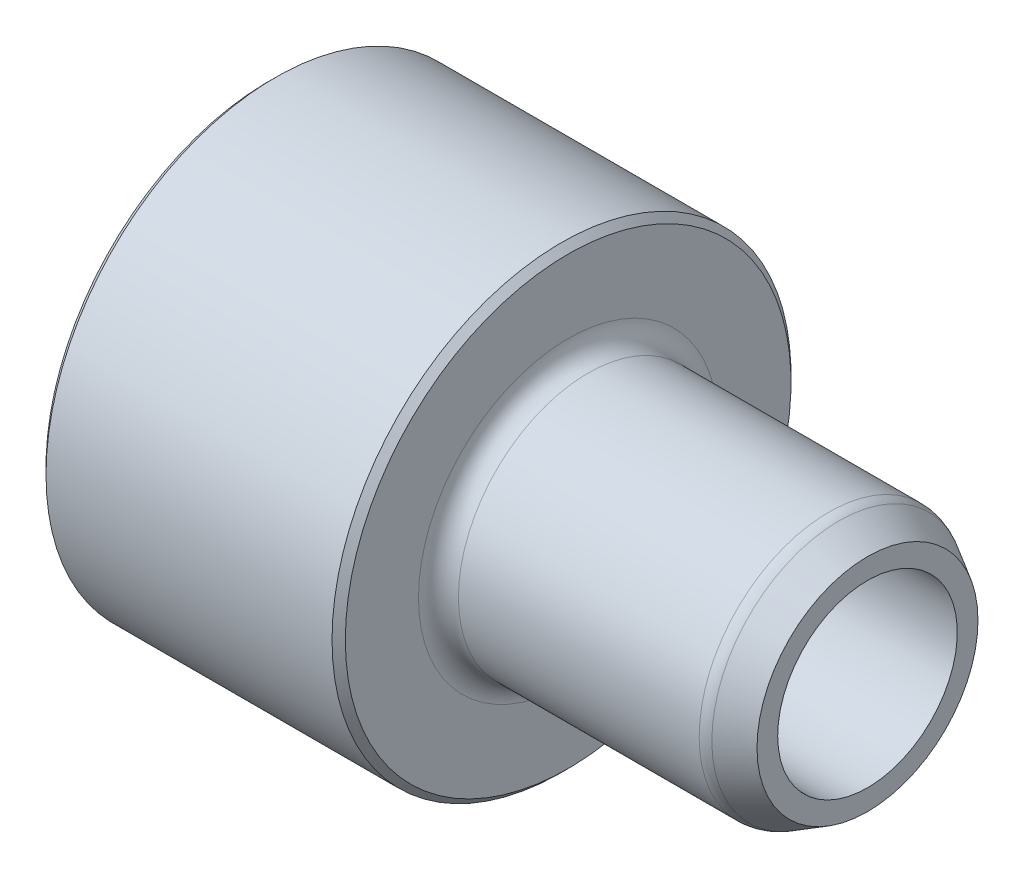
ISO-10303-21;
HEADER;
FILE_DESCRIPTION(('STEP AP214'),'2;1');
FILE_NAME('part.step','',(''),(''),'','','');
FILE_SCHEMA(('AUTOMOTIVE_DESIGN { 1 0 10303 214 1 1 1 1 }'));
ENDSEC;
DATA;
#1=APPLICATION_CONTEXT('core data for automotive mechanical design processes');
#2=APPLICATION_PROTOCOL_DEFINITION('international standard','automotive_design',2000,#1);
#3=PRODUCT_CONTEXT('',#1,'mechanical');
#4=PRODUCT('Part','Part','',(#3));
#5=PRODUCT_RELATED_PRODUCT_CATEGORY('part','',(#4));
#6=PRODUCT_DEFINITION_FORMATION('','',#4);
#7=PRODUCT_DEFINITION_CONTEXT('part definition',#1,'design');
#8=PRODUCT_DEFINITION('design','',#6,#7);
#9=PRODUCT_DEFINITION_SHAPE('','',#8);
#10=(LENGTH_UNIT() NAMED_UNIT(*) SI_UNIT(.MILLI.,.METRE.));
#11=(NAMED_UNIT(*) PLANE_ANGLE_UNIT() SI_UNIT($,.RADIAN.));
#12=(NAMED_UNIT(*) SI_UNIT($,.STERADIAN.) SOLID_ANGLE_UNIT());
#13=UNCERTAINTY_MEASURE_WITH_UNIT(LENGTH_MEASURE(1.E-05),#10,'distance_accuracy_value','');
#14=(GEOMETRIC_REPRESENTATION_CONTEXT(3) GLOBAL_UNCERTAINTY_ASSIGNED_CONTEXT((#13)) GLOBAL_UNIT_ASSIGNED_CONTEXT((#10,
#11,#12)) REPRESENTATION_CONTEXT('',''));
#15=CARTESIAN_POINT('',(0.,0.,0.));
#16=DIRECTION('',(0.,0.,1.));
#17=DIRECTION('',(1.,0.,0.));
#18=AXIS2_PLACEMENT_3D('',#15,#16,#17);
#19=CARTESIAN_POINT('',(0.249999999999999,2.5,0.));
#20=DIRECTION('',(1.,0.,0.));
#21=DIRECTION('',(0.,0.,-1.));
#22=AXIS2_PLACEMENT_3D('',#19,#20,#21);
#23=PLANE('',#22);
#24=CARTESIAN_POINT('',(0.25,0.,0.));
#25=DIRECTION('',(-1.,0.,0.));
#26=DIRECTION('',(0.,0.,1.));
#27=AXIS2_PLACEMENT_3D('',#24,#25,#26);
#28=CIRCLE('',#27,1.35);
#29=CARTESIAN_POINT('',(0.25,0.,1.35));
#30=VERTEX_POINT('',#29);
#31=EDGE_CURVE('E76',#30,#30,#28,.T.);
#32=ORIENTED_EDGE('',*,*,#31,.F.);
#33=EDGE_LOOP('',(#32));
#34=FACE_BOUND('',#33,.T.);
#35=CARTESIAN_POINT('',(0.249999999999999,0.,0.));
#36=DIRECTION('',(-1.,0.,0.));
#37=DIRECTION('',(0.,0.,1.));
#38=AXIS2_PLACEMENT_3D('',#35,#36,#37);
#39=CIRCLE('',#38,2.5);
#40=CARTESIAN_POINT('',(0.249999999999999,0.,2.5));
#41=VERTEX_POINT('',#40);
#42=EDGE_CURVE('E67',#41,#41,#39,.T.);
#43=ORIENTED_EDGE('',*,*,#42,.T.);
#44=EDGE_LOOP('',(#43));
#45=FACE_BOUND('',#44,.T.);
#46=ADVANCED_FACE('F29',(#34,#45),#23,.F.);
#47=CARTESIAN_POINT('',(0.,0.,0.));
#48=DIRECTION('',(-1.,0.,0.));
#49=DIRECTION('',(0.,0.,1.));
#50=AXIS2_PLACEMENT_3D('',#47,#48,#49);
#51=CYLINDRICAL_SURFACE('',#50,2.5);
#52=CARTESIAN_POINT('',(-3.15,0.,0.));
#53=DIRECTION('',(1.,0.,0.));
#54=DIRECTION('',(0.,0.,-1.));
#55=AXIS2_PLACEMENT_3D('',#52,#53,#54);
#56=CIRCLE('',#55,2.5);
#57=CARTESIAN_POINT('',(-3.15,0.,-2.5));
#58=VERTEX_POINT('',#57);
#59=EDGE_CURVE('E36',#58,#58,#56,.F.);
#60=ORIENTED_EDGE('',*,*,#59,.T.);
#61=EDGE_LOOP('',(#60));
#62=FACE_BOUND('',#61,.T.);
#63=ORIENTED_EDGE('',*,*,#42,.F.);
#64=EDGE_LOOP('',(#63));
#65=FACE_BOUND('',#64,.T.);
#66=ADVANCED_FACE('F84',(#62,#65),#51,.F.);
#67=CARTESIAN_POINT('',(-3.25,3.45,0.));
#68=DIRECTION('',(1.,0.,0.));
#69=DIRECTION('',(0.,0.,-1.));
#70=AXIS2_PLACEMENT_3D('',#67,#68,#69);
#71=PLANE('',#70);
#72=CARTESIAN_POINT('',(-3.25,0.,0.));
#73=DIRECTION('',(1.,0.,0.));
#74=DIRECTION('',(0.,0.,-1.));
#75=AXIS2_PLACEMENT_3D('',#72,#73,#74);
#76=CIRCLE('',#75,3.35);
#77=CARTESIAN_POINT('',(-3.25,0.,-3.35));
#78=VERTEX_POINT('',#77);
#79=EDGE_CURVE('E49',#78,#78,#76,.F.);
#80=ORIENTED_EDGE('',*,*,#79,.T.);
#81=EDGE_LOOP('',(#80));
#82=FACE_BOUND('',#81,.T.);
#83=CARTESIAN_POINT('',(-3.25,0.,0.));
#84=DIRECTION('',(1.,0.,0.));
#85=DIRECTION('',(0.,0.,-1.));
#86=AXIS2_PLACEMENT_3D('',#83,#84,#85);
#87=CIRCLE('',#86,2.6);
#88=CARTESIAN_POINT('',(-3.25,0.,-2.6));
#89=VERTEX_POINT('',#88);
#90=EDGE_CURVE('E52',#89,#89,#87,.T.);
#91=ORIENTED_EDGE('',*,*,#90,.T.);
#92=EDGE_LOOP('',(#91));
#93=FACE_BOUND('',#92,.T.);
#94=ADVANCED_FACE('F89',(#82,#93),#71,.F.);
#95=CARTESIAN_POINT('',(0.,0.,0.));
#96=DIRECTION('',(-1.,0.,0.));
#97=DIRECTION('',(0.,0.,1.));
#98=AXIS2_PLACEMENT_3D('',#95,#96,#97);
#99=CYLINDRICAL_SURFACE('',#98,3.45);
#100=CARTESIAN_POINT('',(-3.15,0.,0.));
#101=DIRECTION('',(1.,0.,0.));
#102=DIRECTION('',(0.,0.,-1.));
#103=AXIS2_PLACEMENT_3D('',#100,#101,#102);
#104=CIRCLE('',#103,3.45);
#105=CARTESIAN_POINT('',(-3.15,0.,-3.45));
#106=VERTEX_POINT('',#105);
#107=EDGE_CURVE('E40',#106,#106,#104,.T.);
#108=ORIENTED_EDGE('',*,*,#107,.T.);
#109=EDGE_LOOP('',(#108));
#110=FACE_BOUND('',#109,.T.);
#111=CARTESIAN_POINT('',(1.15,0.,0.));
#112=DIRECTION('',(-1.,0.,0.));
#113=DIRECTION('',(0.,0.,1.));
#114=AXIS2_PLACEMENT_3D('',#111,#112,#113);
#115=CIRCLE('',#114,3.45);
#116=CARTESIAN_POINT('',(1.15,0.,3.45));
#117=VERTEX_POINT('',#116);
#118=EDGE_CURVE('E44',#117,#117,#115,.T.);
#119=ORIENTED_EDGE('',*,*,#118,.T.);
#120=EDGE_LOOP('',(#119));
#121=FACE_BOUND('',#120,.T.);
#122=ADVANCED_FACE('F94',(#110,#121),#99,.T.);
#123=CARTESIAN_POINT('',(1.25,1.95,0.));
#124=DIRECTION('',(-1.,0.,0.));
#125=DIRECTION('',(0.,0.,1.));
#126=AXIS2_PLACEMENT_3D('',#123,#124,#125);
#127=PLANE('',#126);
#128=CARTESIAN_POINT('',(1.25,0.,0.));
#129=DIRECTION('',(-1.,0.,0.));
#130=DIRECTION('',(0.,0.,1.));
#131=AXIS2_PLACEMENT_3D('',#128,#129,#130);
#132=CIRCLE('',#131,3.35);
#133=CARTESIAN_POINT('',(1.25,0.,3.35));
#134=VERTEX_POINT('',#133);
#135=EDGE_CURVE('E10',#134,#134,#132,.F.);
#136=ORIENTED_EDGE('',*,*,#135,.T.);
#137=EDGE_LOOP('',(#136));
#138=FACE_BOUND('',#137,.T.);
#139=CARTESIAN_POINT('',(1.25,0.,0.));
#140=DIRECTION('',(-1.,0.,0.));
#141=DIRECTION('',(0.,0.,1.));
#142=AXIS2_PLACEMENT_3D('',#139,#140,#141);
#143=CIRCLE('',#142,2.25);
#144=CARTESIAN_POINT('',(1.25,0.,2.25));
#145=VERTEX_POINT('',#144);
#146=EDGE_CURVE('E55',#145,#145,#143,.T.);
#147=ORIENTED_EDGE('',*,*,#146,.T.);
#148=EDGE_LOOP('',(#147));
#149=FACE_BOUND('',#148,.T.);
#150=ADVANCED_FACE('F126',(#138,#149),#127,.F.);
#151=CARTESIAN_POINT('',(0.,0.,0.));
#152=DIRECTION('',(-1.,0.,0.));
#153=DIRECTION('',(0.,0.,1.));
#154=AXIS2_PLACEMENT_3D('',#151,#152,#153);
#155=CYLINDRICAL_SURFACE('',#154,1.95);
#156=CARTESIAN_POINT('',(5.16961524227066,0.,0.));
#157=DIRECTION('',(1.,0.,0.));
#158=DIRECTION('',(0.,0.,-1.));
#159=AXIS2_PLACEMENT_3D('',#156,#157,#158);
#160=CIRCLE('',#159,1.95);
#161=CARTESIAN_POINT('',(5.16961524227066,0.,-1.95));
#162=VERTEX_POINT('',#161);
#163=EDGE_CURVE('E61',#162,#162,#160,.F.);
#164=ORIENTED_EDGE('',*,*,#163,.T.);
#165=EDGE_LOOP('',(#164));
#166=FACE_BOUND('',#165,.T.);
#167=CARTESIAN_POINT('',(1.55,0.,0.));
#168=DIRECTION('',(-1.,0.,0.));
#169=DIRECTION('',(0.,0.,1.));
#170=AXIS2_PLACEMENT_3D('',#167,#168,#169);
#171=CIRCLE('',#170,1.95);
#172=CARTESIAN_POINT('',(1.55,0.,1.95));
#173=VERTEX_POINT('',#172);
#174=EDGE_CURVE('E64',#173,#173,#171,.F.);
#175=ORIENTED_EDGE('',*,*,#174,.T.);
#176=EDGE_LOOP('',(#175));
#177=FACE_BOUND('',#176,.T.);
#178=ADVANCED_FACE('F131',(#166,#177),#155,.T.);
#179=CARTESIAN_POINT('',(5.75,0.,0.));
#180=DIRECTION('',(-1.,0.,0.));
#181=DIRECTION('',(0.,0.,1.));
#182=AXIS2_PLACEMENT_3D('',#179,#180,#181);
#183=CONICAL_SURFACE('',#182,1.66132486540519,0.5235987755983);
#184=CARTESIAN_POINT('',(5.31961524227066,0.,0.));
#185=DIRECTION('',(1.,0.,0.));
#186=DIRECTION('',(0.,0.,-1.));
#187=AXIS2_PLACEMENT_3D('',#184,#185,#186);
#188=CIRCLE('',#187,1.90980762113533);
#189=CARTESIAN_POINT('',(5.31961524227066,0.,-1.90980762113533));
#190=VERTEX_POINT('',#189);
#191=EDGE_CURVE('E58',#190,#190,#188,.T.);
#192=ORIENTED_EDGE('',*,*,#191,.T.);
#193=EDGE_LOOP('',(#192));
#194=FACE_BOUND('',#193,.T.);
#195=CARTESIAN_POINT('',(5.75,0.,0.));
#196=DIRECTION('',(-1.,0.,0.));
#197=DIRECTION('',(0.,0.,1.));
#198=AXIS2_PLACEMENT_3D('',#195,#196,#197);
#199=CIRCLE('',#198,1.66132486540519);
#200=CARTESIAN_POINT('',(5.75,0.,1.66132486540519));
#201=VERTEX_POINT('',#200);
#202=EDGE_CURVE('E70',#201,#201,#199,.T.);
#203=ORIENTED_EDGE('',*,*,#202,.T.);
#204=EDGE_LOOP('',(#203));
#205=FACE_BOUND('',#204,.T.);
#206=ADVANCED_FACE('F136',(#194,#205),#183,.T.);
#207=CARTESIAN_POINT('',(5.75,1.35,0.));
#208=DIRECTION('',(-1.,0.,0.));
#209=DIRECTION('',(0.,0.,1.));
#210=AXIS2_PLACEMENT_3D('',#207,#208,#209);
#211=PLANE('',#210);
#212=ORIENTED_EDGE('',*,*,#202,.F.);
#213=EDGE_LOOP('',(#212));
#214=FACE_BOUND('',#213,.T.);
#215=CARTESIAN_POINT('',(5.75,0.,0.));
#216=DIRECTION('',(-1.,0.,0.));
#217=DIRECTION('',(0.,0.,1.));
#218=AXIS2_PLACEMENT_3D('',#215,#216,#217);
#219=CIRCLE('',#218,1.35);
#220=CARTESIAN_POINT('',(5.75,0.,1.35));
#221=VERTEX_POINT('',#220);
#222=EDGE_CURVE('E73',#221,#221,#219,.T.);
#223=ORIENTED_EDGE('',*,*,#222,.T.);
#224=EDGE_LOOP('',(#223));
#225=FACE_BOUND('',#224,.T.);
#226=ADVANCED_FACE('F140',(#214,#225),#211,.F.);
#227=CARTESIAN_POINT('',(0.,0.,0.));
#228=DIRECTION('',(-1.,0.,0.));
#229=DIRECTION('',(0.,0.,1.));
#230=AXIS2_PLACEMENT_3D('',#227,#228,#229);
#231=CYLINDRICAL_SURFACE('',#230,1.35);
#232=ORIENTED_EDGE('',*,*,#222,.F.);
#233=EDGE_LOOP('',(#232));
#234=FACE_BOUND('',#233,.T.);
#235=ORIENTED_EDGE('',*,*,#31,.T.);
#236=EDGE_LOOP('',(#235));
#237=FACE_BOUND('',#236,.T.);
#238=ADVANCED_FACE('F80',(#234,#237),#231,.F.);
#239=CARTESIAN_POINT('',(5.16961524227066,0.,0.));
#240=DIRECTION('',(1.,0.,0.));
#241=DIRECTION('',(0.,0.,-1.));
#242=AXIS2_PLACEMENT_3D('',#239,#240,#241);
#243=TOROIDAL_SURFACE('',#242,1.65,0.3);
#244=ORIENTED_EDGE('',*,*,#191,.F.);
#245=EDGE_LOOP('',(#244));
#246=FACE_BOUND('',#245,.T.);
#247=ORIENTED_EDGE('',*,*,#163,.F.);
#248=EDGE_LOOP('',(#247));
#249=FACE_BOUND('',#248,.T.);
#250=ADVANCED_FACE('F99',(#246,#249),#243,.T.);
#251=CARTESIAN_POINT('',(1.55,0.,0.));
#252=DIRECTION('',(-1.,0.,0.));
#253=DIRECTION('',(0.,0.,1.));
#254=AXIS2_PLACEMENT_3D('',#251,#252,#253);
#255=TOROIDAL_SURFACE('',#254,2.25,0.3);
#256=ORIENTED_EDGE('',*,*,#174,.F.);
#257=EDGE_LOOP('',(#256));
#258=FACE_BOUND('',#257,.T.);
#259=ORIENTED_EDGE('',*,*,#146,.F.);
#260=EDGE_LOOP('',(#259));
#261=FACE_BOUND('',#260,.T.);
#262=ADVANCED_FACE('F102',(#258,#261),#255,.F.);
#263=CARTESIAN_POINT('',(-3.25,0.,0.));
#264=DIRECTION('',(1.,0.,0.));
#265=DIRECTION('',(0.,0.,-1.));
#266=AXIS2_PLACEMENT_3D('',#263,#264,#265);
#267=CONICAL_SURFACE('',#266,3.35,0.785398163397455);
#268=CARTESIAN_POINT('',(-3.15,0.,-3.45));
#269=CARTESIAN_POINT('',(-3.15104166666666,0.,-3.44895833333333));
#270=CARTESIAN_POINT('',(-3.15208333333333,0.,-3.44791666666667));
#271=CARTESIAN_POINT('',(-3.15416666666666,0.,-3.44583333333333));
#272=CARTESIAN_POINT('',(-3.15520833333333,0.,-3.44479166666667));
#273=CARTESIAN_POINT('',(-3.15729166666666,0.,-3.44270833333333));
#274=CARTESIAN_POINT('',(-3.15833333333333,0.,-3.44166666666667));
#275=CARTESIAN_POINT('',(-3.16041666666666,0.,-3.43958333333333));
#276=CARTESIAN_POINT('',(-3.16145833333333,0.,-3.43854166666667));
#277=CARTESIAN_POINT('',(-3.16354166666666,0.,-3.43645833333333));
#278=CARTESIAN_POINT('',(-3.16458333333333,0.,-3.43541666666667));
#279=CARTESIAN_POINT('',(-3.16666666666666,0.,-3.43333333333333));
#280=CARTESIAN_POINT('',(-3.16770833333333,0.,-3.43229166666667));
#281=CARTESIAN_POINT('',(-3.16979166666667,0.,-3.43020833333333));
#282=CARTESIAN_POINT('',(-3.17083333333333,0.,-3.42916666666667));
#283=CARTESIAN_POINT('',(-3.17291666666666,0.,-3.42708333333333));
#284=CARTESIAN_POINT('',(-3.17395833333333,0.,-3.42604166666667));
#285=CARTESIAN_POINT('',(-3.17604166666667,0.,-3.42395833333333));
#286=CARTESIAN_POINT('',(-3.17708333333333,0.,-3.42291666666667));
#287=CARTESIAN_POINT('',(-3.17916666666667,0.,-3.42083333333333));
#288=CARTESIAN_POINT('',(-3.18020833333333,0.,-3.41979166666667));
#289=CARTESIAN_POINT('',(-3.18229166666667,0.,-3.41770833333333));
#290=CARTESIAN_POINT('',(-3.18333333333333,0.,-3.41666666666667));
#291=CARTESIAN_POINT('',(-3.18541666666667,0.,-3.41458333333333));
#292=CARTESIAN_POINT('',(-3.18645833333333,0.,-3.41354166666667));
#293=CARTESIAN_POINT('',(-3.18854166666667,0.,-3.41145833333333));
#294=CARTESIAN_POINT('',(-3.18958333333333,0.,-3.41041666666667));
#295=CARTESIAN_POINT('',(-3.19166666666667,0.,-3.40833333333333));
#296=CARTESIAN_POINT('',(-3.19270833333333,0.,-3.40729166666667));
#297=CARTESIAN_POINT('',(-3.19479166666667,0.,-3.40520833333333));
#298=CARTESIAN_POINT('',(-3.19583333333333,0.,-3.40416666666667));
#299=CARTESIAN_POINT('',(-3.19791666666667,0.,-3.40208333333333));
#300=CARTESIAN_POINT('',(-3.19895833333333,0.,-3.40104166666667));
#301=CARTESIAN_POINT('',(-3.20104166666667,0.,-3.39895833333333));
#302=CARTESIAN_POINT('',(-3.20208333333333,0.,-3.39791666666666));
#303=CARTESIAN_POINT('',(-3.20416666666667,0.,-3.39583333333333));
#304=CARTESIAN_POINT('',(-3.20520833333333,0.,-3.39479166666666));
#305=CARTESIAN_POINT('',(-3.20729166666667,0.,-3.39270833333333));
#306=CARTESIAN_POINT('',(-3.20833333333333,0.,-3.39166666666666));
#307=CARTESIAN_POINT('',(-3.21041666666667,0.,-3.38958333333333));
#308=CARTESIAN_POINT('',(-3.21145833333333,0.,-3.38854166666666));
#309=CARTESIAN_POINT('',(-3.21354166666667,0.,-3.38645833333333));
#310=CARTESIAN_POINT('',(-3.21458333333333,0.,-3.38541666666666));
#311=CARTESIAN_POINT('',(-3.21666666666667,0.,-3.38333333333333));
#312=CARTESIAN_POINT('',(-3.21770833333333,0.,-3.38229166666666));
#313=CARTESIAN_POINT('',(-3.21979166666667,0.,-3.38020833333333));
#314=CARTESIAN_POINT('',(-3.22083333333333,0.,-3.37916666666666));
#315=CARTESIAN_POINT('',(-3.22291666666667,0.,-3.37708333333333));
#316=CARTESIAN_POINT('',(-3.22395833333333,0.,-3.37604166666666));
#317=CARTESIAN_POINT('',(-3.22604166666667,0.,-3.37395833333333));
#318=CARTESIAN_POINT('',(-3.22708333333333,0.,-3.37291666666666));
#319=CARTESIAN_POINT('',(-3.22916666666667,0.,-3.37083333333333));
#320=CARTESIAN_POINT('',(-3.23020833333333,0.,-3.36979166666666));
#321=CARTESIAN_POINT('',(-3.23229166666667,0.,-3.36770833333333));
#322=CARTESIAN_POINT('',(-3.23333333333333,0.,-3.36666666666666));
#323=CARTESIAN_POINT('',(-3.23541666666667,0.,-3.36458333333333));
#324=CARTESIAN_POINT('',(-3.23645833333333,0.,-3.36354166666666));
#325=CARTESIAN_POINT('',(-3.23854166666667,0.,-3.36145833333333));
#326=CARTESIAN_POINT('',(-3.23958333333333,0.,-3.36041666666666));
#327=CARTESIAN_POINT('',(-3.24166666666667,0.,-3.35833333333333));
#328=CARTESIAN_POINT('',(-3.24270833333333,0.,-3.35729166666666));
#329=CARTESIAN_POINT('',(-3.24479166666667,0.,-3.35520833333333));
#330=CARTESIAN_POINT('',(-3.24583333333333,0.,-3.35416666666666));
#331=CARTESIAN_POINT('',(-3.24791666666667,0.,-3.35208333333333));
#332=CARTESIAN_POINT('',(-3.24895833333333,0.,-3.35104166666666));
#333=CARTESIAN_POINT('',(-3.25,0.,-3.35));
#334=B_SPLINE_CURVE_WITH_KNOTS('',3,(#268,#269,#270,#271,#272,#273,#274,#275,#276,#277,#278,
#279,#280,#281,#282,#283,#284,#285,#286,#287,#288,#289,#290,#291,#292,#293,#294,#295,#296,#297,
#298,#299,#300,#301,#302,#303,#304,#305,#306,#307,#308,#309,#310,#311,#312,#313,#314,#315,#316,
#317,#318,#319,#320,#321,#322,#323,#324,#325,#326,#327,#328,#329,#330,#331,#332,#333),
.UNSPECIFIED.,.F.,.F.,(4,2,2,2,2,2,2,2,2,2,2,2,2,2,2,2,2,2,2,2,2,2,2,2,2,2,2,2,2,2,2,2,4),(0.,
0.00441941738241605,0.0088388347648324,0.0132582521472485,0.0176776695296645,0.0220970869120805,
0.0265165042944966,0.0309359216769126,0.0353553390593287,0.0397747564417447,0.0441941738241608,
0.0486135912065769,0.0530330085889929,0.0574524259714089,0.061871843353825,0.066291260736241,
0.0707106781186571,0.0751300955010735,0.0795495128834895,0.0839689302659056,0.0883883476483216,
0.0928077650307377,0.0972271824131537,0.10164659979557,0.106066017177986,0.110485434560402,
0.114904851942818,0.119324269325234,0.12374368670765,0.128163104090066,0.132582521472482,
0.137001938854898,0.141421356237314),.UNSPECIFIED.);
#335=EDGE_CURVE('BSEAM106',#106,#78,#334,.T.);
#336=ORIENTED_EDGE('',*,*,#107,.F.);
#337=ORIENTED_EDGE('',*,*,#79,.F.);
#338=ORIENTED_EDGE('',*,*,#335,.T.);
#339=ORIENTED_EDGE('',*,*,#335,.F.);
#340=EDGE_LOOP('',(#336,#338,#337,#339));
#341=FACE_BOUND('',#340,.T.);
#342=ADVANCED_FACE('F106',(#341),#267,.T.);
#343=CARTESIAN_POINT('',(-3.15,0.,0.));
#344=DIRECTION('',(-1.,0.,0.));
#345=DIRECTION('',(0.,0.,1.));
#346=AXIS2_PLACEMENT_3D('',#343,#344,#345);
#347=CONICAL_SURFACE('',#346,2.5,0.785398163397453);
#348=ORIENTED_EDGE('',*,*,#90,.F.);
#349=EDGE_LOOP('',(#348));
#350=FACE_BOUND('',#349,.T.);
#351=ORIENTED_EDGE('',*,*,#59,.F.);
#352=EDGE_LOOP('',(#351));
#353=FACE_BOUND('',#352,.T.);
#354=ADVANCED_FACE('F109',(#350,#353),#347,.F.);
#355=CARTESIAN_POINT('',(1.15,0.,0.));
#356=DIRECTION('',(-1.,0.,0.));
#357=DIRECTION('',(0.,0.,1.));
#358=AXIS2_PLACEMENT_3D('',#355,#356,#357);
#359=CONICAL_SURFACE('',#358,3.45,0.78539816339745);
#360=ORIENTED_EDGE('',*,*,#135,.F.);
#361=EDGE_LOOP('',(#360));
#362=FACE_BOUND('',#361,.T.);
#363=ORIENTED_EDGE('',*,*,#118,.F.);
#364=EDGE_LOOP('',(#363));
#365=FACE_BOUND('',#364,.T.);
#366=ADVANCED_FACE('F31',(#362,#365),#359,.T.);
#367=CLOSED_SHELL('',(#46,#66,#94,#122,#150,#178,#206,#226,#238,#250,#262,#342,#354,#366));
#368=MANIFOLD_SOLID_BREP('B2',#367);
#369=ADVANCED_BREP_SHAPE_REPRESENTATION('',(#18,#368),#14);
#370=SHAPE_DEFINITION_REPRESENTATION(#9,#369);
ENDSEC;
END-ISO-10303-21;
